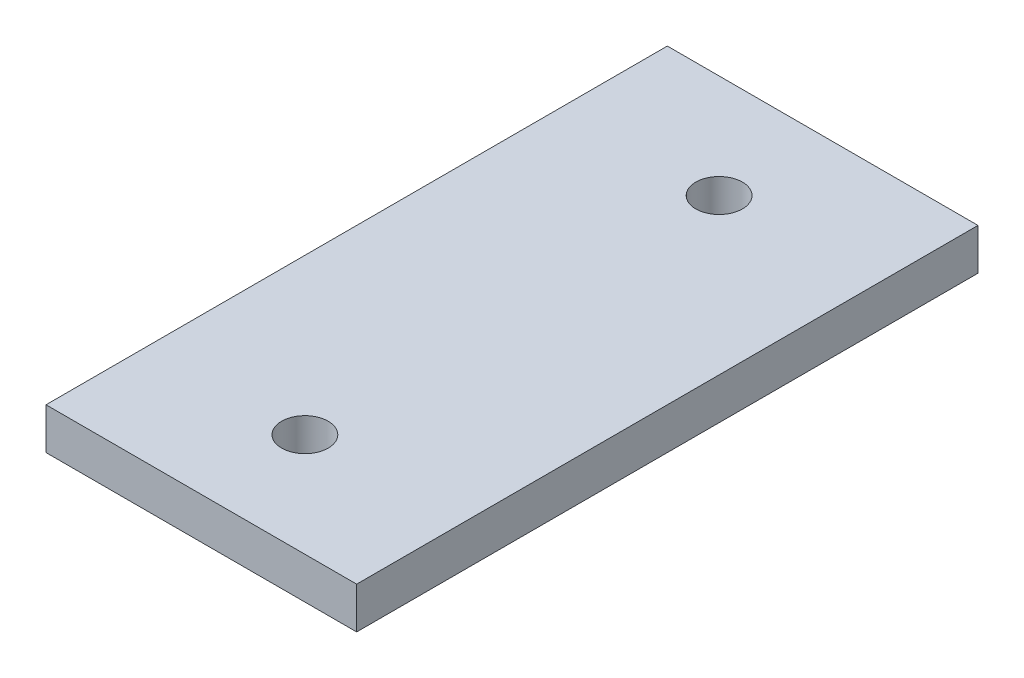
from build123d import *

# Parameters (mm, degrees)
ESQUISSE1_W             = 60
ESQUISSE1_H             = 8
BASE_EXTRUSION_DEPTH    = 120
ESQUISSE2_R             = 4.5
ENL_V_MAT_EXTRU_1_DEPTH = 10


with BuildPart() as part:
    # Esquisse1 → Base-Extrusion (new body)
    with BuildSketch(Plane.XY):
        with Locations((30, -4)):
            Rectangle(ESQUISSE1_W, ESQUISSE1_H)
    extrude(amount=BASE_EXTRUSION_DEPTH)

    # Esquisse2 → Enl_v. mat.-Extru.1 (cut)
    with BuildSketch(Plane(origin=(0, 0, 0), x_dir=(-1, 0, 0), z_dir=(0, 1, 0))):
        with Locations(Location((-30, 100, 0), (0, 0, 90))):
            Circle(ESQUISSE2_R)
        with Locations(Location((-30, 20, 0), (0, 0, 90))):
            Circle(ESQUISSE2_R)
    extrude(amount=-ENL_V_MAT_EXTRU_1_DEPTH, mode=Mode.SUBTRACT)


solid = part.part
